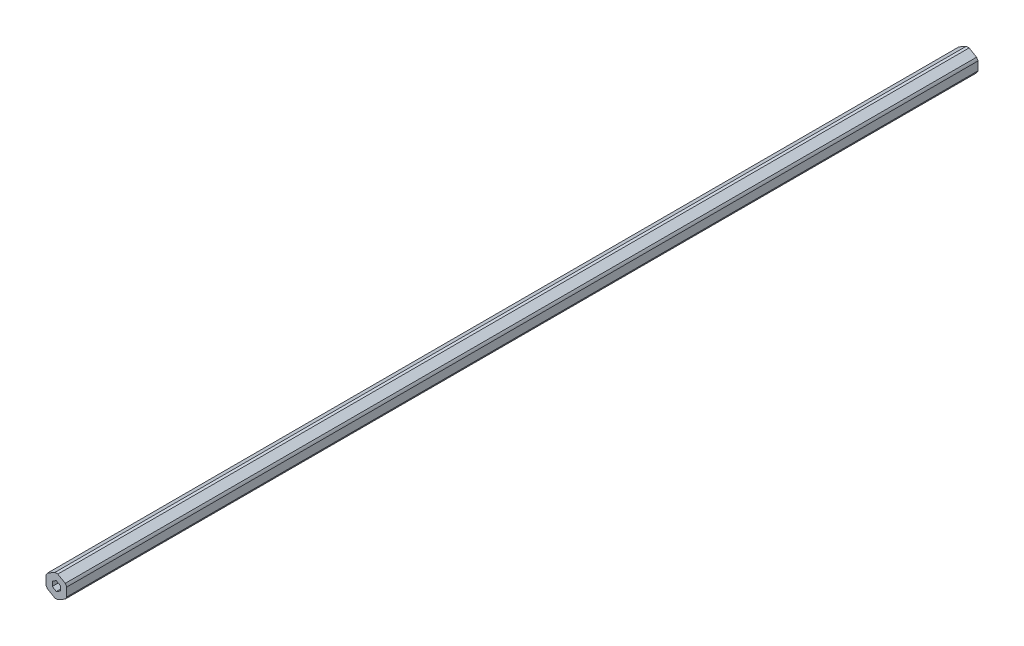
ISO-10303-21;
HEADER;
FILE_DESCRIPTION(('STEP AP214'),'2;1');
FILE_NAME('part.step','',(''),(''),'','','');
FILE_SCHEMA(('AUTOMOTIVE_DESIGN { 1 0 10303 214 1 1 1 1 }'));
ENDSEC;
DATA;
#1=APPLICATION_CONTEXT('core data for automotive mechanical design processes');
#2=APPLICATION_PROTOCOL_DEFINITION('international standard','automotive_design',2000,#1);
#3=PRODUCT_CONTEXT('',#1,'mechanical');
#4=PRODUCT('Part','Part','',(#3));
#5=PRODUCT_RELATED_PRODUCT_CATEGORY('part','',(#4));
#6=PRODUCT_DEFINITION_FORMATION('','',#4);
#7=PRODUCT_DEFINITION_CONTEXT('part definition',#1,'design');
#8=PRODUCT_DEFINITION('design','',#6,#7);
#9=PRODUCT_DEFINITION_SHAPE('','',#8);
#10=(LENGTH_UNIT() NAMED_UNIT(*) SI_UNIT(.MILLI.,.METRE.));
#11=(NAMED_UNIT(*) PLANE_ANGLE_UNIT() SI_UNIT($,.RADIAN.));
#12=(NAMED_UNIT(*) SI_UNIT($,.STERADIAN.) SOLID_ANGLE_UNIT());
#13=UNCERTAINTY_MEASURE_WITH_UNIT(LENGTH_MEASURE(1.E-05),#10,'distance_accuracy_value','');
#14=(GEOMETRIC_REPRESENTATION_CONTEXT(3) GLOBAL_UNCERTAINTY_ASSIGNED_CONTEXT((#13)) GLOBAL_UNIT_ASSIGNED_CONTEXT((#10,
#11,#12)) REPRESENTATION_CONTEXT('',''));
#15=CARTESIAN_POINT('',(0.,0.,0.));
#16=DIRECTION('',(0.,0.,1.));
#17=DIRECTION('',(1.,0.,0.));
#18=AXIS2_PLACEMENT_3D('',#15,#16,#17);
#19=CARTESIAN_POINT('',(0.,0.,457.2));
#20=DIRECTION('',(0.,0.,-1.));
#21=DIRECTION('',(-1.,0.,0.));
#22=AXIS2_PLACEMENT_3D('',#19,#20,#21);
#23=CYLINDRICAL_SURFACE('',#22,6.87);
#24=DIRECTION('',(0.,0.,-1.));
#25=VECTOR('',#24,1.);
#26=CARTESIAN_POINT('',(6.345,-2.63398462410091,457.2));
#27=LINE('',#26,#25);
#28=CARTESIAN_POINT('',(6.345,-2.63398462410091,101.6));
#29=VERTEX_POINT('',#28);
#30=CARTESIAN_POINT('',(6.345,-2.63398462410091,-457.2));
#31=VERTEX_POINT('',#30);
#32=EDGE_CURVE('E300',#29,#31,#27,.T.);
#33=ORIENTED_EDGE('',*,*,#32,.F.);
#34=CARTESIAN_POINT('',(0.,0.,101.6));
#35=DIRECTION('',(0.,0.,1.));
#36=DIRECTION('',(1.,0.,0.));
#37=AXIS2_PLACEMENT_3D('',#34,#35,#36);
#38=CIRCLE('',#37,6.87);
#39=CARTESIAN_POINT('',(5.45359759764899,-4.17793887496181,101.6));
#40=VERTEX_POINT('',#39);
#41=EDGE_CURVE('E244',#40,#29,#38,.T.);
#42=ORIENTED_EDGE('',*,*,#41,.F.);
#43=DIRECTION('',(0.,0.,-1.));
#44=VECTOR('',#43,1.);
#45=CARTESIAN_POINT('',(5.45359759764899,-4.17793887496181,457.2));
#46=LINE('',#45,#44);
#47=CARTESIAN_POINT('',(5.45359759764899,-4.17793887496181,-457.2));
#48=VERTEX_POINT('',#47);
#49=EDGE_CURVE('E54',#40,#48,#46,.T.);
#50=ORIENTED_EDGE('',*,*,#49,.T.);
#51=CARTESIAN_POINT('',(0.,0.,-457.2));
#52=DIRECTION('',(0.,0.,1.));
#53=DIRECTION('',(1.,0.,0.));
#54=AXIS2_PLACEMENT_3D('',#51,#52,#53);
#55=CIRCLE('',#54,6.87);
#56=EDGE_CURVE('E11',#48,#31,#55,.T.);
#57=ORIENTED_EDGE('',*,*,#56,.T.);
#58=EDGE_LOOP('',(#33,#42,#50,#57));
#59=FACE_BOUND('',#58,.T.);
#60=ADVANCED_FACE('F44',(#59),#23,.T.);
#61=CARTESIAN_POINT('',(3.1725,-5.49493118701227,457.2));
#62=DIRECTION('',(-0.5,0.866025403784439,0.));
#63=DIRECTION('',(0.,0.,1.));
#64=AXIS2_PLACEMENT_3D('',#61,#62,#63);
#65=PLANE('',#64);
#66=DIRECTION('',(0.866025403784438,0.5,0.));
#67=VECTOR('',#66,1.);
#68=CARTESIAN_POINT('',(0.891402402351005,-6.81192349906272,101.6));
#69=LINE('',#68,#67);
#70=CARTESIAN_POINT('',(0.891402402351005,-6.81192349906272,101.6));
#71=VERTEX_POINT('',#70);
#72=EDGE_CURVE('E288',#71,#40,#69,.T.);
#73=ORIENTED_EDGE('',*,*,#72,.F.);
#74=DIRECTION('',(0.,0.,-1.));
#75=VECTOR('',#74,1.);
#76=CARTESIAN_POINT('',(0.891402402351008,-6.81192349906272,457.2));
#77=LINE('',#76,#75);
#78=CARTESIAN_POINT('',(0.891402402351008,-6.81192349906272,-457.2));
#79=VERTEX_POINT('',#78);
#80=EDGE_CURVE('E318',#71,#79,#77,.T.);
#81=ORIENTED_EDGE('',*,*,#80,.T.);
#82=DIRECTION('',(0.866025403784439,0.5,0.));
#83=VECTOR('',#82,1.);
#84=CARTESIAN_POINT('',(3.1725,-5.49493118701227,-457.2));
#85=LINE('',#84,#83);
#86=EDGE_CURVE('E314',#79,#48,#85,.T.);
#87=ORIENTED_EDGE('',*,*,#86,.T.);
#88=ORIENTED_EDGE('',*,*,#49,.F.);
#89=EDGE_LOOP('',(#73,#81,#87,#88));
#90=FACE_BOUND('',#89,.T.);
#91=ADVANCED_FACE('F575',(#90),#65,.F.);
#92=CARTESIAN_POINT('',(0.,0.,457.2));
#93=DIRECTION('',(0.,0.,-1.));
#94=DIRECTION('',(-1.,0.,0.));
#95=AXIS2_PLACEMENT_3D('',#92,#93,#94);
#96=CYLINDRICAL_SURFACE('',#95,6.87);
#97=ORIENTED_EDGE('',*,*,#80,.F.);
#98=CARTESIAN_POINT('',(0.,0.,101.6));
#99=DIRECTION('',(0.,0.,1.));
#100=DIRECTION('',(1.,0.,0.));
#101=AXIS2_PLACEMENT_3D('',#98,#99,#100);
#102=CIRCLE('',#101,6.87);
#103=CARTESIAN_POINT('',(-0.891402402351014,-6.81192349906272,101.6));
#104=VERTEX_POINT('',#103);
#105=EDGE_CURVE('E285',#104,#71,#102,.T.);
#106=ORIENTED_EDGE('',*,*,#105,.F.);
#107=DIRECTION('',(0.,0.,-1.));
#108=VECTOR('',#107,1.);
#109=CARTESIAN_POINT('',(-0.891402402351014,-6.81192349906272,457.2));
#110=LINE('',#109,#108);
#111=CARTESIAN_POINT('',(-0.891402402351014,-6.81192349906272,-457.2));
#112=VERTEX_POINT('',#111);
#113=EDGE_CURVE('E305',#104,#112,#110,.T.);
#114=ORIENTED_EDGE('',*,*,#113,.T.);
#115=CARTESIAN_POINT('',(0.,0.,-457.2));
#116=DIRECTION('',(0.,0.,1.));
#117=DIRECTION('',(1.,0.,0.));
#118=AXIS2_PLACEMENT_3D('',#115,#116,#117);
#119=CIRCLE('',#118,6.87);
#120=EDGE_CURVE('E308',#112,#79,#119,.T.);
#121=ORIENTED_EDGE('',*,*,#120,.T.);
#122=EDGE_LOOP('',(#97,#106,#114,#121));
#123=FACE_BOUND('',#122,.T.);
#124=ADVANCED_FACE('F46',(#123),#96,.T.);
#125=CARTESIAN_POINT('',(-3.1725,-5.49493118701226,457.2));
#126=DIRECTION('',(0.5,0.866025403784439,0.));
#127=DIRECTION('',(0.,0.,-1.));
#128=AXIS2_PLACEMENT_3D('',#125,#126,#127);
#129=PLANE('',#128);
#130=DIRECTION('',(0.866025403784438,-0.500000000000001,0.));
#131=VECTOR('',#130,1.);
#132=CARTESIAN_POINT('',(-5.45359759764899,-4.17793887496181,101.6));
#133=LINE('',#132,#131);
#134=CARTESIAN_POINT('',(-5.45359759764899,-4.17793887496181,101.6));
#135=VERTEX_POINT('',#134);
#136=EDGE_CURVE('E282',#135,#104,#133,.T.);
#137=ORIENTED_EDGE('',*,*,#136,.F.);
#138=DIRECTION('',(0.,0.,-1.));
#139=VECTOR('',#138,1.);
#140=CARTESIAN_POINT('',(-5.45359759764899,-4.17793887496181,457.2));
#141=LINE('',#140,#139);
#142=CARTESIAN_POINT('',(-5.45359759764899,-4.17793887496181,-457.2));
#143=VERTEX_POINT('',#142);
#144=EDGE_CURVE('E313',#135,#143,#141,.T.);
#145=ORIENTED_EDGE('',*,*,#144,.T.);
#146=DIRECTION('',(0.866025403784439,-0.5,0.));
#147=VECTOR('',#146,1.);
#148=CARTESIAN_POINT('',(-3.1725,-5.49493118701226,-457.2));
#149=LINE('',#148,#147);
#150=EDGE_CURVE('E309',#143,#112,#149,.T.);
#151=ORIENTED_EDGE('',*,*,#150,.T.);
#152=ORIENTED_EDGE('',*,*,#113,.F.);
#153=EDGE_LOOP('',(#137,#145,#151,#152));
#154=FACE_BOUND('',#153,.T.);
#155=ADVANCED_FACE('F556',(#154),#129,.F.);
#156=CARTESIAN_POINT('',(0.,0.,457.2));
#157=DIRECTION('',(0.,0.,-1.));
#158=DIRECTION('',(-1.,0.,0.));
#159=AXIS2_PLACEMENT_3D('',#156,#157,#158);
#160=CYLINDRICAL_SURFACE('',#159,6.87);
#161=ORIENTED_EDGE('',*,*,#144,.F.);
#162=CARTESIAN_POINT('',(0.,0.,101.6));
#163=DIRECTION('',(0.,0.,1.));
#164=DIRECTION('',(1.,0.,0.));
#165=AXIS2_PLACEMENT_3D('',#162,#163,#164);
#166=CIRCLE('',#165,6.87);
#167=CARTESIAN_POINT('',(-6.345,-2.63398462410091,101.6));
#168=VERTEX_POINT('',#167);
#169=EDGE_CURVE('E279',#168,#135,#166,.T.);
#170=ORIENTED_EDGE('',*,*,#169,.F.);
#171=DIRECTION('',(0.,0.,-1.));
#172=VECTOR('',#171,1.);
#173=CARTESIAN_POINT('',(-6.345,-2.63398462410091,457.2));
#174=LINE('',#173,#172);
#175=CARTESIAN_POINT('',(-6.345,-2.63398462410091,-457.2));
#176=VERTEX_POINT('',#175);
#177=EDGE_CURVE('E340',#168,#176,#174,.T.);
#178=ORIENTED_EDGE('',*,*,#177,.T.);
#179=CARTESIAN_POINT('',(0.,0.,-457.2));
#180=DIRECTION('',(0.,0.,1.));
#181=DIRECTION('',(1.,0.,0.));
#182=AXIS2_PLACEMENT_3D('',#179,#180,#181);
#183=CIRCLE('',#182,6.87);
#184=EDGE_CURVE('E341',#176,#143,#183,.T.);
#185=ORIENTED_EDGE('',*,*,#184,.T.);
#186=EDGE_LOOP('',(#161,#170,#178,#185));
#187=FACE_BOUND('',#186,.T.);
#188=ADVANCED_FACE('F546',(#187),#160,.T.);
#189=CARTESIAN_POINT('',(-6.345,0.,457.2));
#190=DIRECTION('',(1.,0.,0.));
#191=DIRECTION('',(0.,1.,0.));
#192=AXIS2_PLACEMENT_3D('',#189,#190,#191);
#193=PLANE('',#192);
#194=DIRECTION('',(0.,-1.,0.));
#195=VECTOR('',#194,1.);
#196=CARTESIAN_POINT('',(-6.345,2.63398462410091,101.6));
#197=LINE('',#196,#195);
#198=CARTESIAN_POINT('',(-6.34500000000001,2.63398462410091,101.6));
#199=VERTEX_POINT('',#198);
#200=EDGE_CURVE('E276',#199,#168,#197,.T.);
#201=ORIENTED_EDGE('',*,*,#200,.F.);
#202=DIRECTION('',(0.,0.,-1.));
#203=VECTOR('',#202,1.);
#204=CARTESIAN_POINT('',(-6.345,2.63398462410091,457.2));
#205=LINE('',#204,#203);
#206=CARTESIAN_POINT('',(-6.345,2.63398462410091,-457.2));
#207=VERTEX_POINT('',#206);
#208=EDGE_CURVE('E330',#199,#207,#205,.T.);
#209=ORIENTED_EDGE('',*,*,#208,.T.);
#210=DIRECTION('',(0.,-1.,0.));
#211=VECTOR('',#210,1.);
#212=CARTESIAN_POINT('',(-6.345,0.,-457.2));
#213=LINE('',#212,#211);
#214=EDGE_CURVE('E333',#207,#176,#213,.T.);
#215=ORIENTED_EDGE('',*,*,#214,.T.);
#216=ORIENTED_EDGE('',*,*,#177,.F.);
#217=EDGE_LOOP('',(#201,#209,#215,#216));
#218=FACE_BOUND('',#217,.T.);
#219=ADVANCED_FACE('F538',(#218),#193,.F.);
#220=CARTESIAN_POINT('',(0.,0.,457.2));
#221=DIRECTION('',(0.,0.,-1.));
#222=DIRECTION('',(-1.,0.,0.));
#223=AXIS2_PLACEMENT_3D('',#220,#221,#222);
#224=CYLINDRICAL_SURFACE('',#223,6.87);
#225=ORIENTED_EDGE('',*,*,#208,.F.);
#226=CARTESIAN_POINT('',(0.,0.,101.6));
#227=DIRECTION('',(0.,0.,1.));
#228=DIRECTION('',(1.,0.,0.));
#229=AXIS2_PLACEMENT_3D('',#226,#227,#228);
#230=CIRCLE('',#229,6.87);
#231=CARTESIAN_POINT('',(-5.45359759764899,4.17793887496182,101.6));
#232=VERTEX_POINT('',#231);
#233=EDGE_CURVE('E273',#232,#199,#230,.T.);
#234=ORIENTED_EDGE('',*,*,#233,.F.);
#235=DIRECTION('',(0.,0.,-1.));
#236=VECTOR('',#235,1.);
#237=CARTESIAN_POINT('',(-5.45359759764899,4.17793887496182,457.2));
#238=LINE('',#237,#236);
#239=CARTESIAN_POINT('',(-5.45359759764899,4.17793887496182,-457.2));
#240=VERTEX_POINT('',#239);
#241=EDGE_CURVE('E304',#232,#240,#238,.T.);
#242=ORIENTED_EDGE('',*,*,#241,.T.);
#243=CARTESIAN_POINT('',(0.,0.,-457.2));
#244=DIRECTION('',(0.,0.,1.));
#245=DIRECTION('',(1.,0.,0.));
#246=AXIS2_PLACEMENT_3D('',#243,#244,#245);
#247=CIRCLE('',#246,6.87);
#248=EDGE_CURVE('E334',#240,#207,#247,.T.);
#249=ORIENTED_EDGE('',*,*,#248,.T.);
#250=EDGE_LOOP('',(#225,#234,#242,#249));
#251=FACE_BOUND('',#250,.T.);
#252=ADVANCED_FACE('F369',(#251),#224,.T.);
#253=CARTESIAN_POINT('',(-3.1725,5.49493118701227,457.2));
#254=DIRECTION('',(0.5,-0.866025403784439,0.));
#255=DIRECTION('',(0.,0.,-1.));
#256=AXIS2_PLACEMENT_3D('',#253,#254,#255);
#257=PLANE('',#256);
#258=DIRECTION('',(-0.866025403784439,-0.5,0.));
#259=VECTOR('',#258,1.);
#260=CARTESIAN_POINT('',(-0.891402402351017,6.81192349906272,101.6));
#261=LINE('',#260,#259);
#262=CARTESIAN_POINT('',(-0.891402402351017,6.81192349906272,101.6));
#263=VERTEX_POINT('',#262);
#264=EDGE_CURVE('E270',#263,#232,#261,.T.);
#265=ORIENTED_EDGE('',*,*,#264,.F.);
#266=DIRECTION('',(0.,0.,-1.));
#267=VECTOR('',#266,1.);
#268=CARTESIAN_POINT('',(-0.891402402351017,6.81192349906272,457.2));
#269=LINE('',#268,#267);
#270=CARTESIAN_POINT('',(-0.891402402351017,6.81192349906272,-457.2));
#271=VERTEX_POINT('',#270);
#272=EDGE_CURVE('E292',#263,#271,#269,.T.);
#273=ORIENTED_EDGE('',*,*,#272,.T.);
#274=DIRECTION('',(-0.866025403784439,-0.5,0.));
#275=VECTOR('',#274,1.);
#276=CARTESIAN_POINT('',(-3.1725,5.49493118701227,-457.2));
#277=LINE('',#276,#275);
#278=EDGE_CURVE('E295',#271,#240,#277,.T.);
#279=ORIENTED_EDGE('',*,*,#278,.T.);
#280=ORIENTED_EDGE('',*,*,#241,.F.);
#281=EDGE_LOOP('',(#265,#273,#279,#280));
#282=FACE_BOUND('',#281,.T.);
#283=ADVANCED_FACE('F379',(#282),#257,.F.);
#284=CARTESIAN_POINT('',(0.,0.,457.2));
#285=DIRECTION('',(0.,0.,-1.));
#286=DIRECTION('',(-1.,0.,0.));
#287=AXIS2_PLACEMENT_3D('',#284,#285,#286);
#288=CYLINDRICAL_SURFACE('',#287,6.87);
#289=ORIENTED_EDGE('',*,*,#272,.F.);
#290=CARTESIAN_POINT('',(0.,0.,101.6));
#291=DIRECTION('',(0.,0.,1.));
#292=DIRECTION('',(1.,0.,0.));
#293=AXIS2_PLACEMENT_3D('',#290,#291,#292);
#294=CIRCLE('',#293,6.87);
#295=CARTESIAN_POINT('',(0.891402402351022,6.81192349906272,101.6));
#296=VERTEX_POINT('',#295);
#297=EDGE_CURVE('E267',#296,#263,#294,.T.);
#298=ORIENTED_EDGE('',*,*,#297,.F.);
#299=DIRECTION('',(0.,0.,-1.));
#300=VECTOR('',#299,1.);
#301=CARTESIAN_POINT('',(0.891402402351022,6.81192349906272,457.2));
#302=LINE('',#301,#300);
#303=CARTESIAN_POINT('',(0.891402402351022,6.81192349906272,-457.2));
#304=VERTEX_POINT('',#303);
#305=EDGE_CURVE('E319',#296,#304,#302,.T.);
#306=ORIENTED_EDGE('',*,*,#305,.T.);
#307=CARTESIAN_POINT('',(0.,0.,-457.2));
#308=DIRECTION('',(0.,0.,1.));
#309=DIRECTION('',(1.,0.,0.));
#310=AXIS2_PLACEMENT_3D('',#307,#308,#309);
#311=CIRCLE('',#310,6.87);
#312=EDGE_CURVE('E296',#304,#271,#311,.T.);
#313=ORIENTED_EDGE('',*,*,#312,.T.);
#314=EDGE_LOOP('',(#289,#298,#306,#313));
#315=FACE_BOUND('',#314,.T.);
#316=ADVANCED_FACE('F383',(#315),#288,.T.);
#317=CARTESIAN_POINT('',(3.1725,5.49493118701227,457.2));
#318=DIRECTION('',(-0.5,-0.866025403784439,0.));
#319=DIRECTION('',(-0.866025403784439,0.5,0.));
#320=AXIS2_PLACEMENT_3D('',#317,#318,#319);
#321=PLANE('',#320);
#322=DIRECTION('',(-0.866025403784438,0.500000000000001,0.));
#323=VECTOR('',#322,1.);
#324=CARTESIAN_POINT('',(5.45359759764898,4.17793887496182,101.6));
#325=LINE('',#324,#323);
#326=CARTESIAN_POINT('',(5.45359759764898,4.17793887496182,101.6));
#327=VERTEX_POINT('',#326);
#328=EDGE_CURVE('E264',#327,#296,#325,.T.);
#329=ORIENTED_EDGE('',*,*,#328,.F.);
#330=DIRECTION('',(0.,0.,-1.));
#331=VECTOR('',#330,1.);
#332=CARTESIAN_POINT('',(5.45359759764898,4.17793887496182,457.2));
#333=LINE('',#332,#331);
#334=CARTESIAN_POINT('',(5.45359759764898,4.17793887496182,-457.2));
#335=VERTEX_POINT('',#334);
#336=EDGE_CURVE('E326',#327,#335,#333,.T.);
#337=ORIENTED_EDGE('',*,*,#336,.T.);
#338=DIRECTION('',(-0.866025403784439,0.5,0.));
#339=VECTOR('',#338,1.);
#340=CARTESIAN_POINT('',(3.1725,5.49493118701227,-457.2));
#341=LINE('',#340,#339);
#342=EDGE_CURVE('E322',#335,#304,#341,.T.);
#343=ORIENTED_EDGE('',*,*,#342,.T.);
#344=ORIENTED_EDGE('',*,*,#305,.F.);
#345=EDGE_LOOP('',(#329,#337,#343,#344));
#346=FACE_BOUND('',#345,.T.);
#347=ADVANCED_FACE('F390',(#346),#321,.F.);
#348=CARTESIAN_POINT('',(0.,0.,457.2));
#349=DIRECTION('',(0.,0.,-1.));
#350=DIRECTION('',(-1.,0.,0.));
#351=AXIS2_PLACEMENT_3D('',#348,#349,#350);
#352=CYLINDRICAL_SURFACE('',#351,6.87);
#353=ORIENTED_EDGE('',*,*,#336,.F.);
#354=CARTESIAN_POINT('',(0.,0.,101.6));
#355=DIRECTION('',(0.,0.,1.));
#356=DIRECTION('',(1.,0.,0.));
#357=AXIS2_PLACEMENT_3D('',#354,#355,#356);
#358=CIRCLE('',#357,6.87);
#359=CARTESIAN_POINT('',(6.345,2.63398462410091,101.6));
#360=VERTEX_POINT('',#359);
#361=EDGE_CURVE('E261',#360,#327,#358,.T.);
#362=ORIENTED_EDGE('',*,*,#361,.F.);
#363=DIRECTION('',(0.,0.,-1.));
#364=VECTOR('',#363,1.);
#365=CARTESIAN_POINT('',(6.345,2.63398462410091,457.2));
#366=LINE('',#365,#364);
#367=CARTESIAN_POINT('',(6.345,2.63398462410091,-457.2));
#368=VERTEX_POINT('',#367);
#369=EDGE_CURVE('E297',#360,#368,#366,.T.);
#370=ORIENTED_EDGE('',*,*,#369,.T.);
#371=CARTESIAN_POINT('',(0.,0.,-457.2));
#372=DIRECTION('',(0.,0.,1.));
#373=DIRECTION('',(1.,0.,0.));
#374=AXIS2_PLACEMENT_3D('',#371,#372,#373);
#375=CIRCLE('',#374,6.87);
#376=EDGE_CURVE('E48',#368,#335,#375,.T.);
#377=ORIENTED_EDGE('',*,*,#376,.T.);
#378=EDGE_LOOP('',(#353,#362,#370,#377));
#379=FACE_BOUND('',#378,.T.);
#380=ADVANCED_FACE('F394',(#379),#352,.T.);
#381=CARTESIAN_POINT('',(6.345,0.,457.2));
#382=DIRECTION('',(-1.,0.,0.));
#383=DIRECTION('',(0.,1.,0.));
#384=AXIS2_PLACEMENT_3D('',#381,#382,#383);
#385=PLANE('',#384);
#386=DIRECTION('',(0.,1.,0.));
#387=VECTOR('',#386,1.);
#388=CARTESIAN_POINT('',(6.345,-2.63398462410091,101.6));
#389=LINE('',#388,#387);
#390=EDGE_CURVE('E258',#29,#360,#389,.T.);
#391=ORIENTED_EDGE('',*,*,#390,.F.);
#392=ORIENTED_EDGE('',*,*,#32,.T.);
#393=DIRECTION('',(0.,1.,0.));
#394=VECTOR('',#393,1.);
#395=CARTESIAN_POINT('',(6.345,0.,-457.2));
#396=LINE('',#395,#394);
#397=EDGE_CURVE('E291',#31,#368,#396,.T.);
#398=ORIENTED_EDGE('',*,*,#397,.T.);
#399=ORIENTED_EDGE('',*,*,#369,.F.);
#400=EDGE_LOOP('',(#391,#392,#398,#399));
#401=FACE_BOUND('',#400,.T.);
#402=ADVANCED_FACE('F471',(#401),#385,.F.);
#403=CARTESIAN_POINT('',(0.,0.,-457.2));
#404=DIRECTION('',(0.,0.,1.));
#405=DIRECTION('',(1.,0.,0.));
#406=AXIS2_PLACEMENT_3D('',#403,#404,#405);
#407=PLANE('',#406);
#408=DIRECTION('',(0.866025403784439,-0.5,0.));
#409=VECTOR('',#408,1.);
#410=CARTESIAN_POINT('',(-2.5,-1.44337567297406,-457.2));
#411=LINE('',#410,#409);
#412=CARTESIAN_POINT('',(-2.5,-1.44337567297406,-457.2));
#413=VERTEX_POINT('',#412);
#414=CARTESIAN_POINT('',(0.,-2.88675134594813,-457.2));
#415=VERTEX_POINT('',#414);
#416=EDGE_CURVE('E193',#413,#415,#411,.T.);
#417=ORIENTED_EDGE('',*,*,#416,.T.);
#418=DIRECTION('',(0.866025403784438,0.500000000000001,0.));
#419=VECTOR('',#418,1.);
#420=CARTESIAN_POINT('',(0.,-2.88675134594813,-457.2));
#421=LINE('',#420,#419);
#422=CARTESIAN_POINT('',(2.5,-1.44337567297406,-457.2));
#423=VERTEX_POINT('',#422);
#424=EDGE_CURVE('E186',#415,#423,#421,.T.);
#425=ORIENTED_EDGE('',*,*,#424,.T.);
#426=DIRECTION('',(0.,1.,0.));
#427=VECTOR('',#426,1.);
#428=CARTESIAN_POINT('',(2.5,-1.44337567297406,-457.2));
#429=LINE('',#428,#427);
#430=CARTESIAN_POINT('',(2.5,1.44337567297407,-457.2));
#431=VERTEX_POINT('',#430);
#432=EDGE_CURVE('E196',#423,#431,#429,.T.);
#433=ORIENTED_EDGE('',*,*,#432,.T.);
#434=DIRECTION('',(-0.866025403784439,0.5,0.));
#435=VECTOR('',#434,1.);
#436=CARTESIAN_POINT('',(2.5,1.44337567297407,-457.2));
#437=LINE('',#436,#435);
#438=CARTESIAN_POINT('',(0.,2.88675134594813,-457.2));
#439=VERTEX_POINT('',#438);
#440=EDGE_CURVE('E62',#431,#439,#437,.T.);
#441=ORIENTED_EDGE('',*,*,#440,.T.);
#442=DIRECTION('',(-0.866025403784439,-0.5,0.));
#443=VECTOR('',#442,1.);
#444=CARTESIAN_POINT('',(0.,2.88675134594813,-457.2));
#445=LINE('',#444,#443);
#446=CARTESIAN_POINT('',(-2.5,1.44337567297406,-457.2));
#447=VERTEX_POINT('',#446);
#448=EDGE_CURVE('E216',#439,#447,#445,.T.);
#449=ORIENTED_EDGE('',*,*,#448,.T.);
#450=DIRECTION('',(0.,-1.,0.));
#451=VECTOR('',#450,1.);
#452=CARTESIAN_POINT('',(-2.5,1.44337567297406,-457.2));
#453=LINE('',#452,#451);
#454=EDGE_CURVE('E220',#447,#413,#453,.T.);
#455=ORIENTED_EDGE('',*,*,#454,.T.);
#456=EDGE_LOOP('',(#417,#425,#433,#441,#449,#455));
#457=FACE_BOUND('',#456,.T.);
#458=ORIENTED_EDGE('',*,*,#397,.F.);
#459=ORIENTED_EDGE('',*,*,#56,.F.);
#460=ORIENTED_EDGE('',*,*,#86,.F.);
#461=ORIENTED_EDGE('',*,*,#120,.F.);
#462=ORIENTED_EDGE('',*,*,#150,.F.);
#463=ORIENTED_EDGE('',*,*,#184,.F.);
#464=ORIENTED_EDGE('',*,*,#214,.F.);
#465=ORIENTED_EDGE('',*,*,#248,.F.);
#466=ORIENTED_EDGE('',*,*,#278,.F.);
#467=ORIENTED_EDGE('',*,*,#312,.F.);
#468=ORIENTED_EDGE('',*,*,#342,.F.);
#469=ORIENTED_EDGE('',*,*,#376,.F.);
#470=EDGE_LOOP('',(#458,#459,#460,#461,#462,#463,#464,#465,#466,#467,#468,#469));
#471=FACE_BOUND('',#470,.T.);
#472=ADVANCED_FACE('F201',(#457,#471),#407,.F.);
#473=CARTESIAN_POINT('',(0.,0.,101.6));
#474=DIRECTION('',(0.,0.,1.));
#475=DIRECTION('',(1.,0.,0.));
#476=AXIS2_PLACEMENT_3D('',#473,#474,#475);
#477=PLANE('',#476);
#478=DIRECTION('',(0.866025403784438,0.500000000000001,0.));
#479=VECTOR('',#478,1.);
#480=CARTESIAN_POINT('',(0.,-2.88675134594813,101.6));
#481=LINE('',#480,#479);
#482=CARTESIAN_POINT('',(0.,-2.88675134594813,101.6));
#483=VERTEX_POINT('',#482);
#484=CARTESIAN_POINT('',(2.5,-1.44337567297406,101.6));
#485=VERTEX_POINT('',#484);
#486=EDGE_CURVE('E70',#483,#485,#481,.T.);
#487=ORIENTED_EDGE('',*,*,#486,.F.);
#488=DIRECTION('',(0.866025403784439,-0.5,0.));
#489=VECTOR('',#488,1.);
#490=CARTESIAN_POINT('',(-2.5,-1.44337567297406,101.6));
#491=LINE('',#490,#489);
#492=CARTESIAN_POINT('',(-2.5,-1.44337567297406,101.6));
#493=VERTEX_POINT('',#492);
#494=EDGE_CURVE('E206',#493,#483,#491,.T.);
#495=ORIENTED_EDGE('',*,*,#494,.F.);
#496=DIRECTION('',(0.,-1.,0.));
#497=VECTOR('',#496,1.);
#498=CARTESIAN_POINT('',(-2.5,1.44337567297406,101.6));
#499=LINE('',#498,#497);
#500=CARTESIAN_POINT('',(-2.5,1.44337567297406,101.6));
#501=VERTEX_POINT('',#500);
#502=EDGE_CURVE('E211',#501,#493,#499,.T.);
#503=ORIENTED_EDGE('',*,*,#502,.F.);
#504=DIRECTION('',(-0.866025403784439,-0.5,0.));
#505=VECTOR('',#504,1.);
#506=CARTESIAN_POINT('',(0.,2.88675134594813,101.6));
#507=LINE('',#506,#505);
#508=CARTESIAN_POINT('',(0.,2.88675134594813,101.6));
#509=VERTEX_POINT('',#508);
#510=EDGE_CURVE('E234',#509,#501,#507,.T.);
#511=ORIENTED_EDGE('',*,*,#510,.F.);
#512=DIRECTION('',(-0.866025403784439,0.5,0.));
#513=VECTOR('',#512,1.);
#514=CARTESIAN_POINT('',(2.5,1.44337567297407,101.6));
#515=LINE('',#514,#513);
#516=CARTESIAN_POINT('',(2.5,1.44337567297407,101.6));
#517=VERTEX_POINT('',#516);
#518=EDGE_CURVE('E230',#517,#509,#515,.T.);
#519=ORIENTED_EDGE('',*,*,#518,.F.);
#520=DIRECTION('',(0.,1.,0.));
#521=VECTOR('',#520,1.);
#522=CARTESIAN_POINT('',(2.5,-1.44337567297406,101.6));
#523=LINE('',#522,#521);
#524=EDGE_CURVE('E227',#485,#517,#523,.T.);
#525=ORIENTED_EDGE('',*,*,#524,.F.);
#526=EDGE_LOOP('',(#487,#495,#503,#511,#519,#525));
#527=FACE_BOUND('',#526,.T.);
#528=ORIENTED_EDGE('',*,*,#41,.T.);
#529=ORIENTED_EDGE('',*,*,#390,.T.);
#530=ORIENTED_EDGE('',*,*,#361,.T.);
#531=ORIENTED_EDGE('',*,*,#328,.T.);
#532=ORIENTED_EDGE('',*,*,#297,.T.);
#533=ORIENTED_EDGE('',*,*,#264,.T.);
#534=ORIENTED_EDGE('',*,*,#233,.T.);
#535=ORIENTED_EDGE('',*,*,#200,.T.);
#536=ORIENTED_EDGE('',*,*,#169,.T.);
#537=ORIENTED_EDGE('',*,*,#136,.T.);
#538=ORIENTED_EDGE('',*,*,#105,.T.);
#539=ORIENTED_EDGE('',*,*,#72,.T.);
#540=EDGE_LOOP('',(#528,#529,#530,#531,#532,#533,#534,#535,#536,#537,#538,#539));
#541=FACE_BOUND('',#540,.T.);
#542=ADVANCED_FACE('F470',(#527,#541),#477,.T.);
#543=CARTESIAN_POINT('',(0.,-2.88675134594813,-457.2));
#544=DIRECTION('',(0.500000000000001,-0.866025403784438,0.));
#545=DIRECTION('',(0.866025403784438,0.500000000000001,0.));
#546=AXIS2_PLACEMENT_3D('',#543,#544,#545);
#547=PLANE('',#546);
#548=ORIENTED_EDGE('',*,*,#486,.T.);
#549=DIRECTION('',(0.,0.,1.));
#550=VECTOR('',#549,1.);
#551=CARTESIAN_POINT('',(2.5,-1.44337567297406,-457.2));
#552=LINE('',#551,#550);
#553=EDGE_CURVE('E182',#423,#485,#552,.T.);
#554=ORIENTED_EDGE('',*,*,#553,.F.);
#555=ORIENTED_EDGE('',*,*,#424,.F.);
#556=DIRECTION('',(0.,0.,1.));
#557=VECTOR('',#556,1.);
#558=CARTESIAN_POINT('',(0.,-2.88675134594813,-457.2));
#559=LINE('',#558,#557);
#560=EDGE_CURVE('E241',#415,#483,#559,.T.);
#561=ORIENTED_EDGE('',*,*,#560,.T.);
#562=EDGE_LOOP('',(#548,#554,#555,#561));
#563=FACE_BOUND('',#562,.T.);
#564=ADVANCED_FACE('F184',(#563),#547,.F.);
#565=CARTESIAN_POINT('',(-2.5,-1.44337567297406,-457.2));
#566=DIRECTION('',(-0.5,-0.866025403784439,0.));
#567=DIRECTION('',(0.866025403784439,-0.5,0.));
#568=AXIS2_PLACEMENT_3D('',#565,#566,#567);
#569=PLANE('',#568);
#570=ORIENTED_EDGE('',*,*,#494,.T.);
#571=ORIENTED_EDGE('',*,*,#560,.F.);
#572=ORIENTED_EDGE('',*,*,#416,.F.);
#573=DIRECTION('',(0.,0.,1.));
#574=VECTOR('',#573,1.);
#575=CARTESIAN_POINT('',(-2.5,-1.44337567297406,-457.2));
#576=LINE('',#575,#574);
#577=EDGE_CURVE('E245',#413,#493,#576,.T.);
#578=ORIENTED_EDGE('',*,*,#577,.T.);
#579=EDGE_LOOP('',(#570,#571,#572,#578));
#580=FACE_BOUND('',#579,.T.);
#581=ADVANCED_FACE('F610',(#580),#569,.F.);
#582=CARTESIAN_POINT('',(-2.5,1.44337567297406,-457.2));
#583=DIRECTION('',(-1.,0.,0.));
#584=DIRECTION('',(0.,-1.,0.));
#585=AXIS2_PLACEMENT_3D('',#582,#583,#584);
#586=PLANE('',#585);
#587=ORIENTED_EDGE('',*,*,#502,.T.);
#588=ORIENTED_EDGE('',*,*,#577,.F.);
#589=ORIENTED_EDGE('',*,*,#454,.F.);
#590=DIRECTION('',(0.,0.,1.));
#591=VECTOR('',#590,1.);
#592=CARTESIAN_POINT('',(-2.5,1.44337567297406,-457.2));
#593=LINE('',#592,#591);
#594=EDGE_CURVE('E248',#447,#501,#593,.T.);
#595=ORIENTED_EDGE('',*,*,#594,.T.);
#596=EDGE_LOOP('',(#587,#588,#589,#595));
#597=FACE_BOUND('',#596,.T.);
#598=ADVANCED_FACE('F619',(#597),#586,.F.);
#599=CARTESIAN_POINT('',(0.,2.88675134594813,-457.2));
#600=DIRECTION('',(-0.5,0.866025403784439,0.));
#601=DIRECTION('',(-0.866025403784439,-0.5,0.));
#602=AXIS2_PLACEMENT_3D('',#599,#600,#601);
#603=PLANE('',#602);
#604=ORIENTED_EDGE('',*,*,#510,.T.);
#605=ORIENTED_EDGE('',*,*,#594,.F.);
#606=ORIENTED_EDGE('',*,*,#448,.F.);
#607=DIRECTION('',(0.,0.,1.));
#608=VECTOR('',#607,1.);
#609=CARTESIAN_POINT('',(0.,2.88675134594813,-457.2));
#610=LINE('',#609,#608);
#611=EDGE_CURVE('E251',#439,#509,#610,.T.);
#612=ORIENTED_EDGE('',*,*,#611,.T.);
#613=EDGE_LOOP('',(#604,#605,#606,#612));
#614=FACE_BOUND('',#613,.T.);
#615=ADVANCED_FACE('F629',(#614),#603,.F.);
#616=CARTESIAN_POINT('',(2.5,1.44337567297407,-457.2));
#617=DIRECTION('',(0.5,0.866025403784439,0.));
#618=DIRECTION('',(-0.866025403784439,0.5,0.));
#619=AXIS2_PLACEMENT_3D('',#616,#617,#618);
#620=PLANE('',#619);
#621=ORIENTED_EDGE('',*,*,#518,.T.);
#622=ORIENTED_EDGE('',*,*,#611,.F.);
#623=ORIENTED_EDGE('',*,*,#440,.F.);
#624=DIRECTION('',(0.,0.,1.));
#625=VECTOR('',#624,1.);
#626=CARTESIAN_POINT('',(2.5,1.44337567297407,-457.2));
#627=LINE('',#626,#625);
#628=EDGE_CURVE('E192',#431,#517,#627,.T.);
#629=ORIENTED_EDGE('',*,*,#628,.T.);
#630=EDGE_LOOP('',(#621,#622,#623,#629));
#631=FACE_BOUND('',#630,.T.);
#632=ADVANCED_FACE('F639',(#631),#620,.F.);
#633=CARTESIAN_POINT('',(2.5,-1.44337567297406,-457.2));
#634=DIRECTION('',(1.,0.,0.));
#635=DIRECTION('',(0.,0.,-1.));
#636=AXIS2_PLACEMENT_3D('',#633,#634,#635);
#637=PLANE('',#636);
#638=ORIENTED_EDGE('',*,*,#524,.T.);
#639=ORIENTED_EDGE('',*,*,#628,.F.);
#640=ORIENTED_EDGE('',*,*,#432,.F.);
#641=ORIENTED_EDGE('',*,*,#553,.T.);
#642=EDGE_LOOP('',(#638,#639,#640,#641));
#643=FACE_BOUND('',#642,.T.);
#644=ADVANCED_FACE('F197',(#643),#637,.F.);
#645=CLOSED_SHELL('',(#60,#91,#124,#155,#188,#219,#252,#283,#316,#347,#380,#402,#472,#542,#564,
#581,#598,#615,#632,#644));
#646=MANIFOLD_SOLID_BREP('B2',#645);
#647=ADVANCED_BREP_SHAPE_REPRESENTATION('',(#18,#646),#14);
#648=SHAPE_DEFINITION_REPRESENTATION(#9,#647);
ENDSEC;
END-ISO-10303-21;
